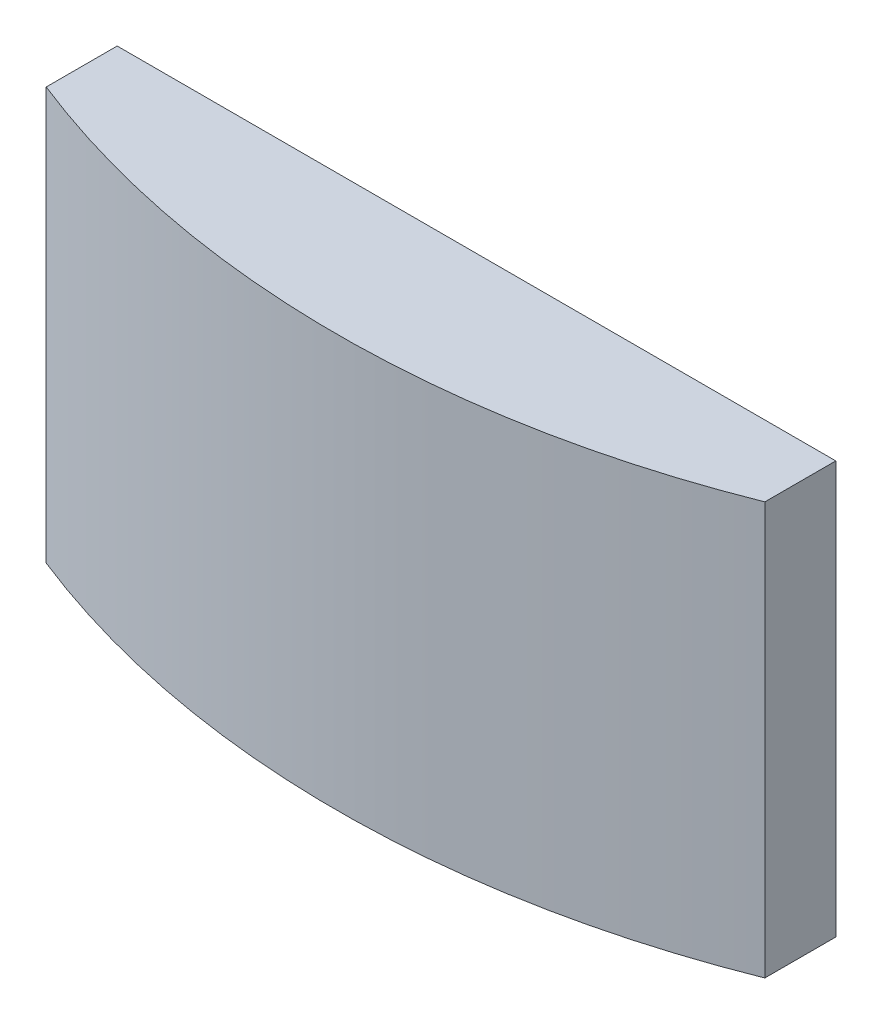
ISO-10303-21;
HEADER;
FILE_DESCRIPTION(('STEP AP214'),'2;1');
FILE_NAME('part.step','',(''),(''),'','','');
FILE_SCHEMA(('AUTOMOTIVE_DESIGN { 1 0 10303 214 1 1 1 1 }'));
ENDSEC;
DATA;
#1=APPLICATION_CONTEXT('core data for automotive mechanical design processes');
#2=APPLICATION_PROTOCOL_DEFINITION('international standard','automotive_design',2000,#1);
#3=PRODUCT_CONTEXT('',#1,'mechanical');
#4=PRODUCT('Part','Part','',(#3));
#5=PRODUCT_RELATED_PRODUCT_CATEGORY('part','',(#4));
#6=PRODUCT_DEFINITION_FORMATION('','',#4);
#7=PRODUCT_DEFINITION_CONTEXT('part definition',#1,'design');
#8=PRODUCT_DEFINITION('design','',#6,#7);
#9=PRODUCT_DEFINITION_SHAPE('','',#8);
#10=(LENGTH_UNIT() NAMED_UNIT(*) SI_UNIT(.MILLI.,.METRE.));
#11=(NAMED_UNIT(*) PLANE_ANGLE_UNIT() SI_UNIT($,.RADIAN.));
#12=(NAMED_UNIT(*) SI_UNIT($,.STERADIAN.) SOLID_ANGLE_UNIT());
#13=UNCERTAINTY_MEASURE_WITH_UNIT(LENGTH_MEASURE(1.E-05),#10,'distance_accuracy_value','');
#14=(GEOMETRIC_REPRESENTATION_CONTEXT(3) GLOBAL_UNCERTAINTY_ASSIGNED_CONTEXT((#13)) GLOBAL_UNIT_ASSIGNED_CONTEXT((#10,
#11,#12)) REPRESENTATION_CONTEXT('',''));
#15=CARTESIAN_POINT('',(0.,0.,0.));
#16=DIRECTION('',(0.,0.,1.));
#17=DIRECTION('',(1.,0.,0.));
#18=AXIS2_PLACEMENT_3D('',#15,#16,#17);
#19=CARTESIAN_POINT('',(1.12058823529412,69.4428014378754,-152.267457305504));
#20=DIRECTION('',(0.,-1.,0.));
#21=DIRECTION('',(0.,0.,-1.));
#22=AXIS2_PLACEMENT_3D('',#19,#20,#21);
#23=CYLINDRICAL_SURFACE('',#22,163.850701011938);
#24=CARTESIAN_POINT('',(1.12058823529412,0.,-152.267457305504));
#25=DIRECTION('',(0.,1.,0.));
#26=DIRECTION('',(0.,0.,1.));
#27=AXIS2_PLACEMENT_3D('',#24,#25,#26);
#28=CIRCLE('',#27,163.850701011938);
#29=CARTESIAN_POINT('',(-59.3911764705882,0.,0.));
#30=VERTEX_POINT('',#29);
#31=CARTESIAN_POINT('',(61.6323529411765,0.,0.));
#32=VERTEX_POINT('',#31);
#33=EDGE_CURVE('E76',#30,#32,#28,.T.);
#34=ORIENTED_EDGE('',*,*,#33,.T.);
#35=DIRECTION('',(0.,-1.,0.));
#36=VECTOR('',#35,1.);
#37=CARTESIAN_POINT('',(61.6323529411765,69.4428014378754,0.));
#38=LINE('',#37,#36);
#39=CARTESIAN_POINT('',(61.6323529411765,69.4428014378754,0.));
#40=VERTEX_POINT('',#39);
#41=EDGE_CURVE('E11',#40,#32,#38,.T.);
#42=ORIENTED_EDGE('',*,*,#41,.F.);
#43=CARTESIAN_POINT('',(1.12058823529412,69.4428014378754,-152.267457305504));
#44=DIRECTION('',(0.,1.,0.));
#45=DIRECTION('',(0.,0.,1.));
#46=AXIS2_PLACEMENT_3D('',#43,#44,#45);
#47=CIRCLE('',#46,163.850701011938);
#48=CARTESIAN_POINT('',(-59.3911764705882,69.4428014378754,0.));
#49=VERTEX_POINT('',#48);
#50=EDGE_CURVE('E94',#49,#40,#47,.T.);
#51=ORIENTED_EDGE('',*,*,#50,.F.);
#52=DIRECTION('',(0.,-1.,0.));
#53=VECTOR('',#52,1.);
#54=CARTESIAN_POINT('',(-59.3911764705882,69.4428014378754,0.));
#55=LINE('',#54,#53);
#56=EDGE_CURVE('E88',#49,#30,#55,.T.);
#57=ORIENTED_EDGE('',*,*,#56,.T.);
#58=EDGE_LOOP('',(#34,#42,#51,#57));
#59=FACE_BOUND('',#58,.T.);
#60=ADVANCED_FACE('F32',(#59),#23,.T.);
#61=CARTESIAN_POINT('',(61.6323529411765,69.4428014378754,-11.9529411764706));
#62=DIRECTION('',(-1.,0.,0.));
#63=DIRECTION('',(0.,0.,1.));
#64=AXIS2_PLACEMENT_3D('',#61,#62,#63);
#65=PLANE('',#64);
#66=DIRECTION('',(0.,0.,-1.));
#67=VECTOR('',#66,1.);
#68=CARTESIAN_POINT('',(61.6323529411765,0.,-11.9529411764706));
#69=LINE('',#68,#67);
#70=CARTESIAN_POINT('',(61.6323529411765,0.,-11.9529411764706));
#71=VERTEX_POINT('',#70);
#72=EDGE_CURVE('E72',#32,#71,#69,.T.);
#73=ORIENTED_EDGE('',*,*,#72,.T.);
#74=DIRECTION('',(0.,-1.,0.));
#75=VECTOR('',#74,1.);
#76=CARTESIAN_POINT('',(61.6323529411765,69.4428014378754,-11.9529411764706));
#77=LINE('',#76,#75);
#78=CARTESIAN_POINT('',(61.6323529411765,69.4428014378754,-11.9529411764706));
#79=VERTEX_POINT('',#78);
#80=EDGE_CURVE('E39',#79,#71,#77,.T.);
#81=ORIENTED_EDGE('',*,*,#80,.F.);
#82=DIRECTION('',(0.,0.,-1.));
#83=VECTOR('',#82,1.);
#84=CARTESIAN_POINT('',(61.6323529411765,69.4428014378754,-11.9529411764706));
#85=LINE('',#84,#83);
#86=EDGE_CURVE('E84',#40,#79,#85,.T.);
#87=ORIENTED_EDGE('',*,*,#86,.F.);
#88=ORIENTED_EDGE('',*,*,#41,.T.);
#89=EDGE_LOOP('',(#73,#81,#87,#88));
#90=FACE_BOUND('',#89,.T.);
#91=ADVANCED_FACE('F83',(#90),#65,.F.);
#92=CARTESIAN_POINT('',(-59.3911764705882,69.4428014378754,-11.9529411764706));
#93=DIRECTION('',(0.,0.,1.));
#94=DIRECTION('',(1.,0.,0.));
#95=AXIS2_PLACEMENT_3D('',#92,#93,#94);
#96=PLANE('',#95);
#97=DIRECTION('',(-1.,0.,0.));
#98=VECTOR('',#97,1.);
#99=CARTESIAN_POINT('',(-59.3911764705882,0.,-11.9529411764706));
#100=LINE('',#99,#98);
#101=CARTESIAN_POINT('',(-59.3911764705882,0.,-11.9529411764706));
#102=VERTEX_POINT('',#101);
#103=EDGE_CURVE('E77',#71,#102,#100,.T.);
#104=ORIENTED_EDGE('',*,*,#103,.T.);
#105=DIRECTION('',(0.,-1.,0.));
#106=VECTOR('',#105,1.);
#107=CARTESIAN_POINT('',(-59.3911764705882,69.4428014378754,-11.9529411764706));
#108=LINE('',#107,#106);
#109=CARTESIAN_POINT('',(-59.3911764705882,69.4428014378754,-11.9529411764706));
#110=VERTEX_POINT('',#109);
#111=EDGE_CURVE('E100',#110,#102,#108,.T.);
#112=ORIENTED_EDGE('',*,*,#111,.F.);
#113=DIRECTION('',(-1.,0.,0.));
#114=VECTOR('',#113,1.);
#115=CARTESIAN_POINT('',(-59.3911764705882,69.4428014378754,-11.9529411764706));
#116=LINE('',#115,#114);
#117=EDGE_CURVE('E51',#79,#110,#116,.T.);
#118=ORIENTED_EDGE('',*,*,#117,.F.);
#119=ORIENTED_EDGE('',*,*,#80,.T.);
#120=EDGE_LOOP('',(#104,#112,#118,#119));
#121=FACE_BOUND('',#120,.T.);
#122=ADVANCED_FACE('F103',(#121),#96,.F.);
#123=CARTESIAN_POINT('',(-59.3911764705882,69.4428014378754,0.));
#124=DIRECTION('',(1.,0.,0.));
#125=DIRECTION('',(0.,0.,-1.));
#126=AXIS2_PLACEMENT_3D('',#123,#124,#125);
#127=PLANE('',#126);
#128=DIRECTION('',(0.,0.,1.));
#129=VECTOR('',#128,1.);
#130=CARTESIAN_POINT('',(-59.3911764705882,0.,0.));
#131=LINE('',#130,#129);
#132=EDGE_CURVE('E92',#102,#30,#131,.T.);
#133=ORIENTED_EDGE('',*,*,#132,.T.);
#134=ORIENTED_EDGE('',*,*,#56,.F.);
#135=DIRECTION('',(0.,0.,1.));
#136=VECTOR('',#135,1.);
#137=CARTESIAN_POINT('',(-59.3911764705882,69.4428014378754,0.));
#138=LINE('',#137,#136);
#139=EDGE_CURVE('E46',#110,#49,#138,.T.);
#140=ORIENTED_EDGE('',*,*,#139,.F.);
#141=ORIENTED_EDGE('',*,*,#111,.T.);
#142=EDGE_LOOP('',(#133,#134,#140,#141));
#143=FACE_BOUND('',#142,.T.);
#144=ADVANCED_FACE('F105',(#143),#127,.F.);
#145=CARTESIAN_POINT('',(1.12058823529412,69.4428014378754,-152.267457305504));
#146=DIRECTION('',(0.,1.,0.));
#147=DIRECTION('',(0.,0.,1.));
#148=AXIS2_PLACEMENT_3D('',#145,#146,#147);
#149=PLANE('',#148);
#150=ORIENTED_EDGE('',*,*,#50,.T.);
#151=ORIENTED_EDGE('',*,*,#86,.T.);
#152=ORIENTED_EDGE('',*,*,#117,.T.);
#153=ORIENTED_EDGE('',*,*,#139,.T.);
#154=EDGE_LOOP('',(#150,#151,#152,#153));
#155=FACE_BOUND('',#154,.T.);
#156=ADVANCED_FACE('F106',(#155),#149,.T.);
#157=CARTESIAN_POINT('',(1.12058823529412,0.,-152.267457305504));
#158=DIRECTION('',(0.,1.,0.));
#159=DIRECTION('',(0.,0.,1.));
#160=AXIS2_PLACEMENT_3D('',#157,#158,#159);
#161=PLANE('',#160);
#162=ORIENTED_EDGE('',*,*,#33,.F.);
#163=ORIENTED_EDGE('',*,*,#132,.F.);
#164=ORIENTED_EDGE('',*,*,#103,.F.);
#165=ORIENTED_EDGE('',*,*,#72,.F.);
#166=EDGE_LOOP('',(#162,#163,#164,#165));
#167=FACE_BOUND('',#166,.T.);
#168=ADVANCED_FACE('F73',(#167),#161,.F.);
#169=CLOSED_SHELL('',(#60,#91,#122,#144,#156,#168));
#170=MANIFOLD_SOLID_BREP('B2',#169);
#171=ADVANCED_BREP_SHAPE_REPRESENTATION('',(#18,#170),#14);
#172=SHAPE_DEFINITION_REPRESENTATION(#9,#171);
ENDSEC;
END-ISO-10303-21;
